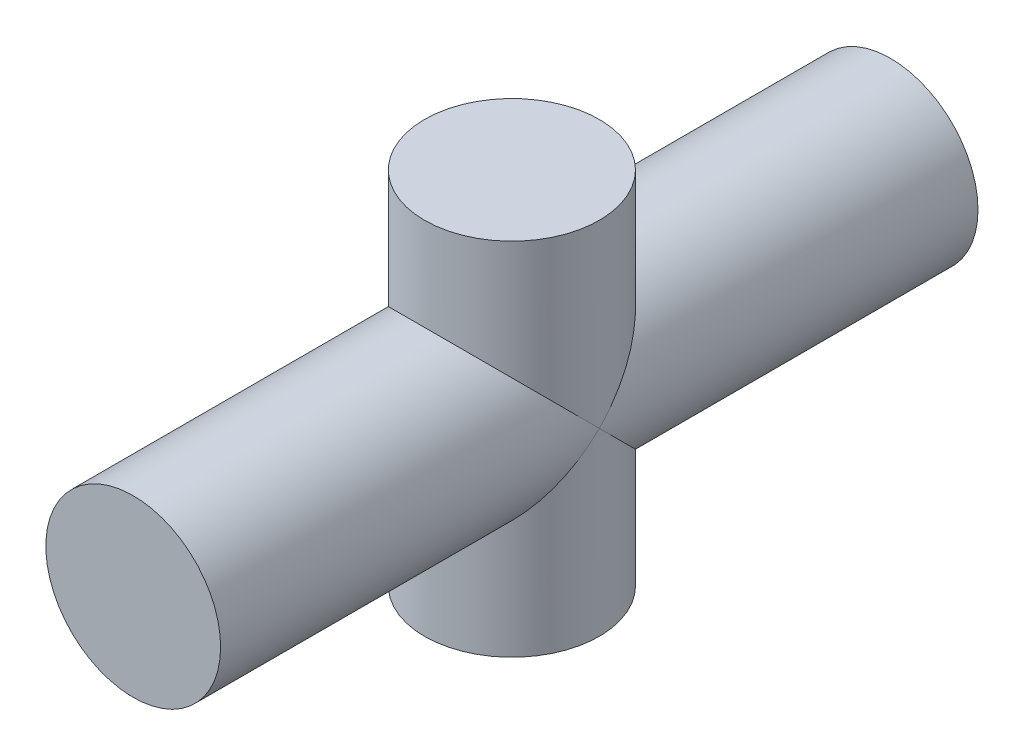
ISO-10303-21;
HEADER;
FILE_DESCRIPTION(('STEP AP214'),'2;1');
FILE_NAME('part.step','',(''),(''),'','','');
FILE_SCHEMA(('AUTOMOTIVE_DESIGN { 1 0 10303 214 1 1 1 1 }'));
ENDSEC;
DATA;
#1=APPLICATION_CONTEXT('core data for automotive mechanical design processes');
#2=APPLICATION_PROTOCOL_DEFINITION('international standard','automotive_design',2000,#1);
#3=PRODUCT_CONTEXT('',#1,'mechanical');
#4=PRODUCT('Part','Part','',(#3));
#5=PRODUCT_RELATED_PRODUCT_CATEGORY('part','',(#4));
#6=PRODUCT_DEFINITION_FORMATION('','',#4);
#7=PRODUCT_DEFINITION_CONTEXT('part definition',#1,'design');
#8=PRODUCT_DEFINITION('design','',#6,#7);
#9=PRODUCT_DEFINITION_SHAPE('','',#8);
#10=(LENGTH_UNIT() NAMED_UNIT(*) SI_UNIT(.MILLI.,.METRE.));
#11=(NAMED_UNIT(*) PLANE_ANGLE_UNIT() SI_UNIT($,.RADIAN.));
#12=(NAMED_UNIT(*) SI_UNIT($,.STERADIAN.) SOLID_ANGLE_UNIT());
#13=UNCERTAINTY_MEASURE_WITH_UNIT(LENGTH_MEASURE(1.E-05),#10,'distance_accuracy_value','');
#14=(GEOMETRIC_REPRESENTATION_CONTEXT(3) GLOBAL_UNCERTAINTY_ASSIGNED_CONTEXT((#13)) GLOBAL_UNIT_ASSIGNED_CONTEXT((#10,
#11,#12)) REPRESENTATION_CONTEXT('',''));
#15=CARTESIAN_POINT('',(0.,0.,0.));
#16=DIRECTION('',(0.,0.,1.));
#17=DIRECTION('',(1.,0.,0.));
#18=AXIS2_PLACEMENT_3D('',#15,#16,#17);
#19=CARTESIAN_POINT('',(0.,61.85,0.));
#20=DIRECTION('',(0.,-1.,0.));
#21=DIRECTION('',(0.,0.,-1.));
#22=AXIS2_PLACEMENT_3D('',#19,#20,#21);
#23=CYLINDRICAL_SURFACE('',#22,15.);
#24=CARTESIAN_POINT('',(0.,61.85,0.));
#25=DIRECTION('',(0.,1.,0.));
#26=DIRECTION('',(0.,0.,1.));
#27=AXIS2_PLACEMENT_3D('',#24,#25,#26);
#28=CIRCLE('',#27,15.);
#29=CARTESIAN_POINT('',(0.,61.85,15.));
#30=VERTEX_POINT('',#29);
#31=EDGE_CURVE('E55',#30,#30,#28,.T.);
#32=ORIENTED_EDGE('',*,*,#31,.F.);
#33=EDGE_LOOP('',(#32));
#34=FACE_BOUND('',#33,.T.);
#35=CARTESIAN_POINT('',(0.,30.925,0.));
#36=DIRECTION('',(0.,-0.707106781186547,-0.707106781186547));
#37=DIRECTION('',(0.,-0.707106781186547,0.707106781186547));
#38=AXIS2_PLACEMENT_3D('',#35,#36,#37);
#39=ELLIPSE('',#38,21.2132034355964,15.);
#40=CARTESIAN_POINT('',(-15.,30.925,0.));
#41=VERTEX_POINT('',#40);
#42=CARTESIAN_POINT('',(15.,30.925,0.));
#43=VERTEX_POINT('',#42);
#44=EDGE_CURVE('E39',#41,#43,#39,.T.);
#45=ORIENTED_EDGE('',*,*,#44,.F.);
#46=CARTESIAN_POINT('',(0.,30.925,0.));
#47=DIRECTION('',(0.,-0.707106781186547,0.707106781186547));
#48=DIRECTION('',(0.,-0.707106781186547,-0.707106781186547));
#49=AXIS2_PLACEMENT_3D('',#46,#47,#48);
#50=ELLIPSE('',#49,21.2132034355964,15.);
#51=EDGE_CURVE('E51',#43,#41,#50,.T.);
#52=ORIENTED_EDGE('',*,*,#51,.F.);
#53=EDGE_LOOP('',(#45,#52));
#54=FACE_BOUND('',#53,.T.);
#55=ADVANCED_FACE('F31',(#34,#54),#23,.T.);
#56=CARTESIAN_POINT('',(0.,61.85,0.));
#57=DIRECTION('',(0.,1.,0.));
#58=DIRECTION('',(0.,0.,1.));
#59=AXIS2_PLACEMENT_3D('',#56,#57,#58);
#60=PLANE('',#59);
#61=ORIENTED_EDGE('',*,*,#31,.T.);
#62=EDGE_LOOP('',(#61));
#63=FACE_BOUND('',#62,.T.);
#64=ADVANCED_FACE('F78',(#63),#60,.T.);
#65=CARTESIAN_POINT('',(0.,30.925,-65.));
#66=DIRECTION('',(0.,0.,1.));
#67=DIRECTION('',(1.,0.,0.));
#68=AXIS2_PLACEMENT_3D('',#65,#66,#67);
#69=PLANE('',#68);
#70=CARTESIAN_POINT('',(0.,30.925,-65.));
#71=DIRECTION('',(0.,0.,1.));
#72=DIRECTION('',(1.,0.,0.));
#73=AXIS2_PLACEMENT_3D('',#70,#71,#72);
#74=CIRCLE('',#73,15.);
#75=CARTESIAN_POINT('',(15.,30.925,-65.));
#76=VERTEX_POINT('',#75);
#77=EDGE_CURVE('E92',#76,#76,#74,.T.);
#78=ORIENTED_EDGE('',*,*,#77,.F.);
#79=EDGE_LOOP('',(#78));
#80=FACE_BOUND('',#79,.T.);
#81=ADVANCED_FACE('F75',(#80),#69,.F.);
#82=CARTESIAN_POINT('',(0.,30.925,65.));
#83=DIRECTION('',(0.,0.,-1.));
#84=DIRECTION('',(-1.,0.,0.));
#85=AXIS2_PLACEMENT_3D('',#82,#83,#84);
#86=CYLINDRICAL_SURFACE('',#85,15.);
#87=ORIENTED_EDGE('',*,*,#77,.T.);
#88=EDGE_LOOP('',(#87));
#89=FACE_BOUND('',#88,.T.);
#90=CARTESIAN_POINT('',(0.,30.925,0.));
#91=DIRECTION('',(0.,-0.707106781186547,0.707106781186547));
#92=DIRECTION('',(0.,-0.707106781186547,-0.707106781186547));
#93=AXIS2_PLACEMENT_3D('',#90,#91,#92);
#94=ELLIPSE('',#93,21.2132034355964,15.);
#95=EDGE_CURVE('E45',#43,#41,#94,.F.);
#96=ORIENTED_EDGE('',*,*,#95,.T.);
#97=ORIENTED_EDGE('',*,*,#44,.T.);
#98=EDGE_LOOP('',(#96,#97));
#99=FACE_BOUND('',#98,.T.);
#100=ADVANCED_FACE('F57',(#89,#99),#86,.T.);
#101=CARTESIAN_POINT('',(0.,0.,0.));
#102=DIRECTION('',(0.,1.,0.));
#103=DIRECTION('',(0.,0.,1.));
#104=AXIS2_PLACEMENT_3D('',#101,#102,#103);
#105=PLANE('',#104);
#106=CARTESIAN_POINT('',(0.,0.,0.));
#107=DIRECTION('',(0.,1.,0.));
#108=DIRECTION('',(0.,0.,1.));
#109=AXIS2_PLACEMENT_3D('',#106,#107,#108);
#110=CIRCLE('',#109,15.);
#111=CARTESIAN_POINT('',(0.,0.,15.));
#112=VERTEX_POINT('',#111);
#113=EDGE_CURVE('E86',#112,#112,#110,.T.);
#114=ORIENTED_EDGE('',*,*,#113,.F.);
#115=EDGE_LOOP('',(#114));
#116=FACE_BOUND('',#115,.T.);
#117=ADVANCED_FACE('F69',(#116),#105,.F.);
#118=ORIENTED_EDGE('',*,*,#113,.T.);
#119=EDGE_LOOP('',(#118));
#120=FACE_BOUND('',#119,.T.);
#121=CARTESIAN_POINT('',(0.,30.925,0.));
#122=DIRECTION('',(0.,-0.707106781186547,-0.707106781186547));
#123=DIRECTION('',(0.,-0.707106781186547,0.707106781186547));
#124=AXIS2_PLACEMENT_3D('',#121,#122,#123);
#125=ELLIPSE('',#124,21.2132034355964,15.);
#126=EDGE_CURVE('E11',#41,#43,#125,.F.);
#127=ORIENTED_EDGE('',*,*,#126,.F.);
#128=ORIENTED_EDGE('',*,*,#95,.F.);
#129=EDGE_LOOP('',(#127,#128));
#130=FACE_BOUND('',#129,.T.);
#131=ADVANCED_FACE('F33',(#120,#130),#23,.T.);
#132=CARTESIAN_POINT('',(0.,30.925,65.));
#133=DIRECTION('',(0.,0.,1.));
#134=DIRECTION('',(1.,0.,0.));
#135=AXIS2_PLACEMENT_3D('',#132,#133,#134);
#136=CIRCLE('',#135,15.);
#137=CARTESIAN_POINT('',(15.,30.925,65.));
#138=VERTEX_POINT('',#137);
#139=EDGE_CURVE('E89',#138,#138,#136,.T.);
#140=ORIENTED_EDGE('',*,*,#139,.F.);
#141=EDGE_LOOP('',(#140));
#142=FACE_BOUND('',#141,.T.);
#143=ORIENTED_EDGE('',*,*,#51,.T.);
#144=ORIENTED_EDGE('',*,*,#126,.T.);
#145=EDGE_LOOP('',(#143,#144));
#146=FACE_BOUND('',#145,.T.);
#147=ADVANCED_FACE('F58',(#142,#146),#86,.T.);
#148=CARTESIAN_POINT('',(0.,30.925,65.));
#149=DIRECTION('',(0.,0.,1.));
#150=DIRECTION('',(1.,0.,0.));
#151=AXIS2_PLACEMENT_3D('',#148,#149,#150);
#152=PLANE('',#151);
#153=ORIENTED_EDGE('',*,*,#139,.T.);
#154=EDGE_LOOP('',(#153));
#155=FACE_BOUND('',#154,.T.);
#156=ADVANCED_FACE('F60',(#155),#152,.T.);
#157=CLOSED_SHELL('',(#55,#64,#81,#100,#117,#131,#147,#156));
#158=MANIFOLD_SOLID_BREP('B2',#157);
#159=ADVANCED_BREP_SHAPE_REPRESENTATION('',(#18,#158),#14);
#160=SHAPE_DEFINITION_REPRESENTATION(#9,#159);
ENDSEC;
END-ISO-10303-21;
